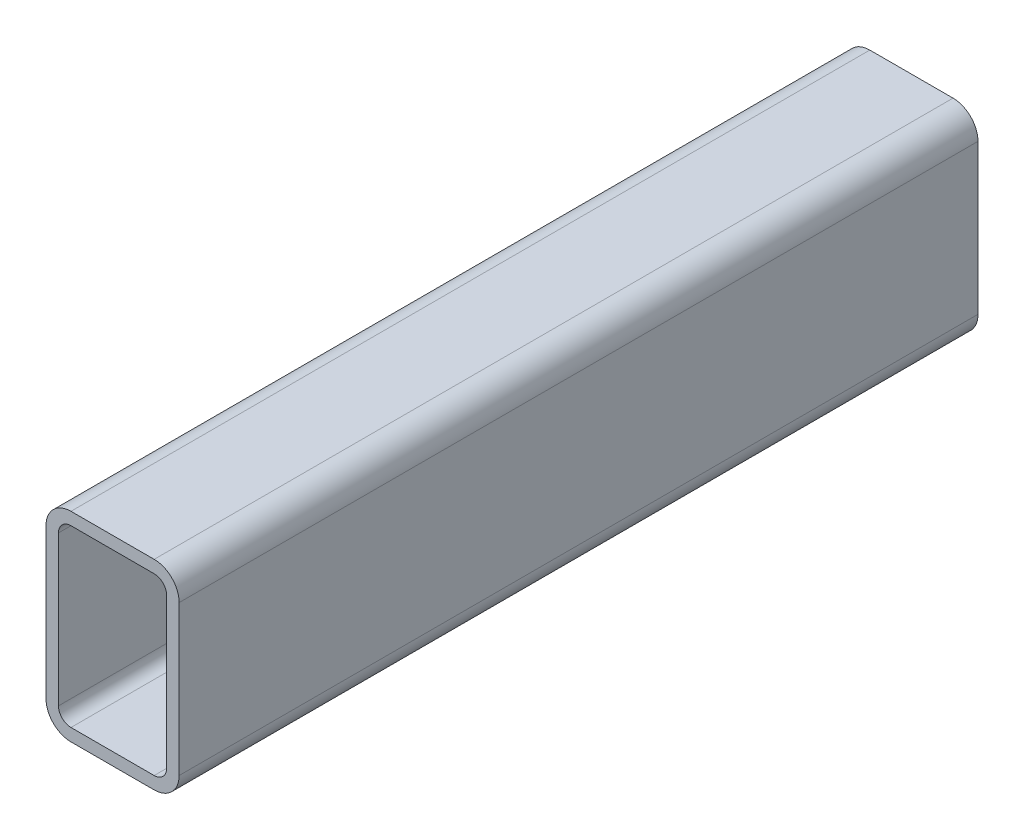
from build123d import *

# Parameters (mm, degrees)
BOSS_EXTRUDE1_DEPTH = 304.8


with BuildPart() as part:
    # Sketch1 → Boss-Extrude1 (new body)
    with BuildSketch(Plane.XY):
        with BuildLine():
            Line((9.525, 76.2), (41.275, 76.2))
            ThreePointArc((41.275, 76.2), (48.010192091, 73.410192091), (50.8, 66.675))
            Line((50.8, 66.675), (50.8, 9.525))
            ThreePointArc((50.8, 9.525), (48.010192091, 2.789807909), (41.275, 0))
            Line((41.275, 0), (9.525, 0))
            ThreePointArc((9.525, 0), (2.789807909, 2.789807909), (0, 9.525))
            Line((0, 9.525), (0, 66.675))
            ThreePointArc((0, 66.675), (2.789807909, 73.410192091), (9.525, 76.2))
        make_face()
        with BuildLine():
            Line((9.525, 71.4375), (41.275, 71.4375))
            ThreePointArc((41.275, 71.4375), (44.642596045, 70.042596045), (46.0375, 66.675))
            Line((46.0375, 66.675), (46.0375, 9.525))
            ThreePointArc((46.0375, 9.525), (44.642596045, 6.157403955), (41.275, 4.7625))
            Line((41.275, 4.7625), (9.525, 4.7625))
            ThreePointArc((9.525, 4.7625), (6.157403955, 6.157403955), (4.7625, 9.525))
            Line((4.7625, 9.525), (4.7625, 66.675))
            ThreePointArc((4.7625, 66.675), (6.157403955, 70.042596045), (9.525, 71.4375))
        make_face(mode=Mode.SUBTRACT)
    extrude(amount=BOSS_EXTRUDE1_DEPTH)


solid = part.part
